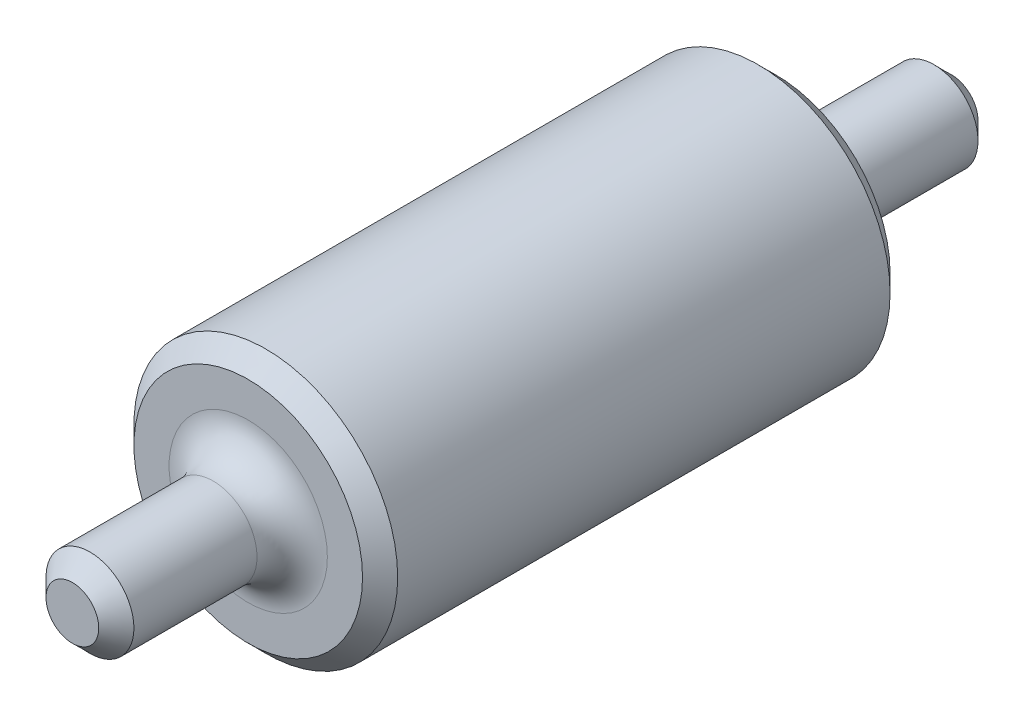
from build123d import *

# Parameters (mm, degrees)
ESQUISSE1_R        = 7.5
BOSS_EXTRU_1_DEPTH = 15
ESQUISSE2_R        = 2.5
BOSS_EXTRU_2_DEPTH = 10
CHANFREIN1_SIZE    = 1
CONG_1_R           = 2


with BuildPart() as part:
    # Esquisse1 → Boss.-Extru.1 (new, symmetric)
    with BuildSketch(Plane.XY):
        Circle(ESQUISSE1_R)
    extrude(amount=BOSS_EXTRU_1_DEPTH, both=True)

    # Esquisse2 → Boss.-Extru.2 (add)
    with BuildSketch(Plane.XY.offset(15)):
        Circle(ESQUISSE2_R)
    boss_extru_2 = extrude(amount=BOSS_EXTRU_2_DEPTH)

    # Sym_trie1: Boss.-Extru.2 across plane
    add(boss_extru_2.mirror(Plane.XY))

    # Chanfrein1
    chanfrein1_edges = [part.edges().sort_by_distance(p)[0] for p in [
        (-2.5, 0, -25),
        (-7.5, 0, -15),
        (-7.5, 0, 15),
        (-2.5, 0, 25),
    ]]
    chamfer(chanfrein1_edges, length=CHANFREIN1_SIZE)

    # Cong_1
    cong_1_edges = [part.edges().sort_by_distance(p)[0] for p in [
        (-2.5, 0, -15),
        (-2.5, 0, 15),
    ]]
    fillet(cong_1_edges, radius=CONG_1_R)


solid = part.part
